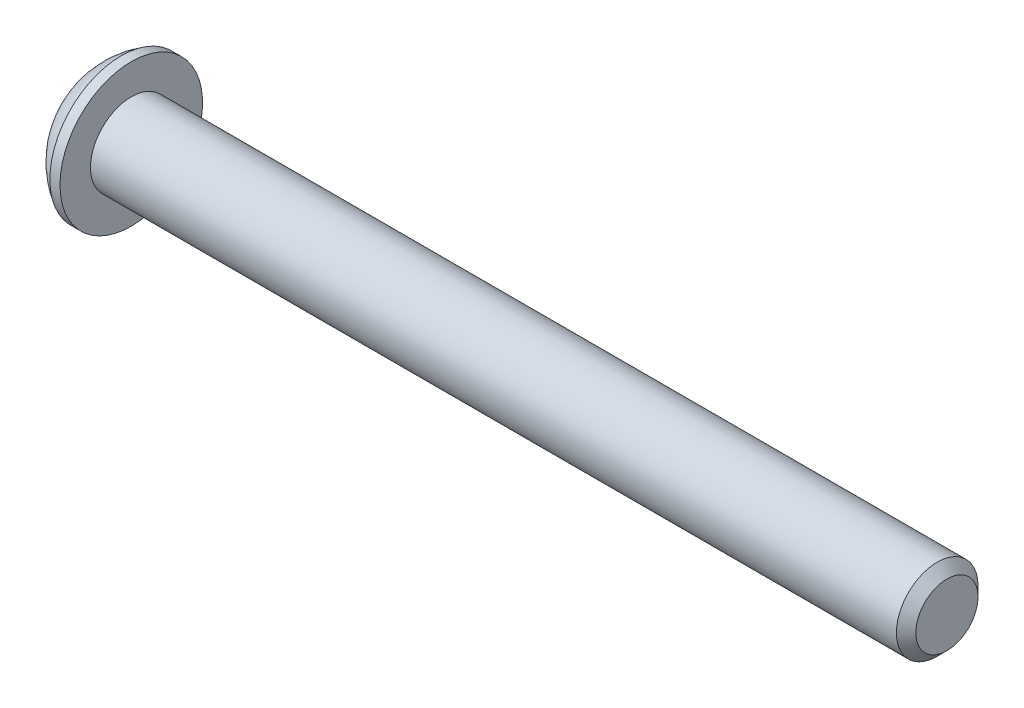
ISO-10303-21;
HEADER;
FILE_DESCRIPTION(('STEP AP214'),'2;1');
FILE_NAME('part.step','',(''),(''),'','','');
FILE_SCHEMA(('AUTOMOTIVE_DESIGN { 1 0 10303 214 1 1 1 1 }'));
ENDSEC;
DATA;
#1=APPLICATION_CONTEXT('core data for automotive mechanical design processes');
#2=APPLICATION_PROTOCOL_DEFINITION('international standard','automotive_design',2000,#1);
#3=PRODUCT_CONTEXT('',#1,'mechanical');
#4=PRODUCT('Part','Part','',(#3));
#5=PRODUCT_RELATED_PRODUCT_CATEGORY('part','',(#4));
#6=PRODUCT_DEFINITION_FORMATION('','',#4);
#7=PRODUCT_DEFINITION_CONTEXT('part definition',#1,'design');
#8=PRODUCT_DEFINITION('design','',#6,#7);
#9=PRODUCT_DEFINITION_SHAPE('','',#8);
#10=(LENGTH_UNIT() NAMED_UNIT(*) SI_UNIT(.MILLI.,.METRE.));
#11=(NAMED_UNIT(*) PLANE_ANGLE_UNIT() SI_UNIT($,.RADIAN.));
#12=(NAMED_UNIT(*) SI_UNIT($,.STERADIAN.) SOLID_ANGLE_UNIT());
#13=UNCERTAINTY_MEASURE_WITH_UNIT(LENGTH_MEASURE(1.E-05),#10,'distance_accuracy_value','');
#14=(GEOMETRIC_REPRESENTATION_CONTEXT(3) GLOBAL_UNCERTAINTY_ASSIGNED_CONTEXT((#13)) GLOBAL_UNIT_ASSIGNED_CONTEXT((#10,
#11,#12)) REPRESENTATION_CONTEXT('',''));
#15=CARTESIAN_POINT('',(0.,0.,0.));
#16=DIRECTION('',(0.,0.,1.));
#17=DIRECTION('',(1.,0.,0.));
#18=AXIS2_PLACEMENT_3D('',#15,#16,#17);
#19=CARTESIAN_POINT('',(0.,0.,0.));
#20=DIRECTION('',(-1.,0.,0.));
#21=DIRECTION('',(0.,0.,1.));
#22=AXIS2_PLACEMENT_3D('',#19,#20,#21);
#23=PLANE('',#22);
#24=CARTESIAN_POINT('',(0.,0.,0.));
#25=DIRECTION('',(-1.,0.,0.));
#26=DIRECTION('',(0.,0.,1.));
#27=AXIS2_PLACEMENT_3D('',#24,#25,#26);
#28=CIRCLE('',#27,2.77495);
#29=CARTESIAN_POINT('',(0.,2.77495,0.));
#30=VERTEX_POINT('',#29);
#31=EDGE_CURVE('E11',#30,#30,#28,.T.);
#32=ORIENTED_EDGE('',*,*,#31,.T.);
#33=EDGE_LOOP('',(#32));
#34=FACE_BOUND('',#33,.T.);
#35=DIRECTION('',(0.,-1.,0.));
#36=VECTOR('',#35,1.);
#37=CARTESIAN_POINT('',(0.,-1.14384635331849,1.9812));
#38=LINE('',#37,#36);
#39=CARTESIAN_POINT('',(0.,1.14384635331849,1.9812));
#40=VERTEX_POINT('',#39);
#41=CARTESIAN_POINT('',(0.,-1.14384635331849,1.9812));
#42=VERTEX_POINT('',#41);
#43=EDGE_CURVE('E46',#40,#42,#38,.T.);
#44=ORIENTED_EDGE('',*,*,#43,.T.);
#45=DIRECTION('',(0.,-0.5,-0.866025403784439));
#46=VECTOR('',#45,1.);
#47=CARTESIAN_POINT('',(0.,-2.28769270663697,0.));
#48=LINE('',#47,#46);
#49=CARTESIAN_POINT('',(0.,-2.28769270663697,0.));
#50=VERTEX_POINT('',#49);
#51=EDGE_CURVE('E362',#42,#50,#48,.T.);
#52=ORIENTED_EDGE('',*,*,#51,.T.);
#53=DIRECTION('',(0.,0.5,-0.866025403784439));
#54=VECTOR('',#53,1.);
#55=CARTESIAN_POINT('',(0.,-1.14384635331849,-1.9812));
#56=LINE('',#55,#54);
#57=CARTESIAN_POINT('',(0.,-1.14384635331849,-1.9812));
#58=VERTEX_POINT('',#57);
#59=EDGE_CURVE('E126',#50,#58,#56,.T.);
#60=ORIENTED_EDGE('',*,*,#59,.T.);
#61=DIRECTION('',(0.,1.,0.));
#62=VECTOR('',#61,1.);
#63=CARTESIAN_POINT('',(0.,1.14384635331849,-1.9812));
#64=LINE('',#63,#62);
#65=CARTESIAN_POINT('',(0.,1.14384635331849,-1.9812));
#66=VERTEX_POINT('',#65);
#67=EDGE_CURVE('E365',#58,#66,#64,.T.);
#68=ORIENTED_EDGE('',*,*,#67,.T.);
#69=DIRECTION('',(0.,0.5,0.866025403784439));
#70=VECTOR('',#69,1.);
#71=CARTESIAN_POINT('',(0.,2.28769270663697,0.));
#72=LINE('',#71,#70);
#73=CARTESIAN_POINT('',(0.,2.28769270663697,0.));
#74=VERTEX_POINT('',#73);
#75=EDGE_CURVE('E367',#66,#74,#72,.T.);
#76=ORIENTED_EDGE('',*,*,#75,.T.);
#77=DIRECTION('',(0.,-0.5,0.866025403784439));
#78=VECTOR('',#77,1.);
#79=CARTESIAN_POINT('',(0.,1.14384635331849,1.9812));
#80=LINE('',#79,#78);
#81=EDGE_CURVE('E369',#74,#40,#80,.T.);
#82=ORIENTED_EDGE('',*,*,#81,.T.);
#83=EDGE_LOOP('',(#44,#52,#60,#68,#76,#82));
#84=FACE_BOUND('',#83,.T.);
#85=ADVANCED_FACE('F32',(#34,#84),#23,.T.);
#86=CARTESIAN_POINT('',(5.78512506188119,0.,0.));
#87=DIRECTION('',(-1.,0.,0.));
#88=DIRECTION('',(0.,1.,0.));
#89=AXIS2_PLACEMENT_3D('',#86,#87,#88);
#90=SPHERICAL_SURFACE('',#89,6.41623094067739);
#91=CARTESIAN_POINT('',(2.5654,0.,0.));
#92=DIRECTION('',(-1.,0.,0.));
#93=DIRECTION('',(0.,0.,1.));
#94=AXIS2_PLACEMENT_3D('',#91,#92,#93);
#95=CIRCLE('',#94,5.5499);
#96=CARTESIAN_POINT('',(2.5654,5.5499,0.));
#97=VERTEX_POINT('',#96);
#98=EDGE_CURVE('E39',#97,#97,#95,.T.);
#99=CARTESIAN_POINT('',(2.5654,5.5499,0.));
#100=CARTESIAN_POINT('',(2.53083708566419,5.52984868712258,0.));
#101=CARTESIAN_POINT('',(2.49646152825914,5.50947442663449,0.));
#102=CARTESIAN_POINT('',(2.42809701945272,5.4680872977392,0.));
#103=CARTESIAN_POINT('',(2.39410806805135,5.447074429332,0.));
#104=CARTESIAN_POINT('',(2.32652866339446,5.40441737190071,0.));
#105=CARTESIAN_POINT('',(2.29293821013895,5.38277318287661,0.));
#106=CARTESIAN_POINT('',(2.22616751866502,5.33886105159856,0.));
#107=CARTESIAN_POINT('',(2.19298728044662,5.3165931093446,0.));
#108=CARTESIAN_POINT('',(2.12704860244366,5.27144124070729,0.));
#109=CARTESIAN_POINT('',(2.09429016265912,5.24855731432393,0.));
#110=CARTESIAN_POINT('',(2.02920651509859,5.20218146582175,0.));
#111=CARTESIAN_POINT('',(1.99688130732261,5.17868954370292,0.));
#112=CARTESIAN_POINT('',(1.93267540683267,5.13110590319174,0.));
#113=CARTESIAN_POINT('',(1.90079471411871,5.10701418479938,0.));
#114=CARTESIAN_POINT('',(1.83748897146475,5.05823936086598,0.));
#115=CARTESIAN_POINT('',(1.80606392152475,5.03355625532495,0.));
#116=CARTESIAN_POINT('',(1.74368043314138,4.98360727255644,0.));
#117=CARTESIAN_POINT('',(1.71272199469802,4.95834139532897,0.));
#118=CARTESIAN_POINT('',(1.65128253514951,4.90723568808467,0.));
#119=CARTESIAN_POINT('',(1.62080151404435,4.88139585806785,0.));
#120=CARTESIAN_POINT('',(1.56032752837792,4.82915126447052,0.));
#121=CARTESIAN_POINT('',(1.53033456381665,4.80274650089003,0.));
#122=CARTESIAN_POINT('',(1.4708471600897,4.74938125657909,0.));
#123=CARTESIAN_POINT('',(1.44135272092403,4.72242077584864,0.));
#124=CARTESIAN_POINT('',(1.38287266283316,4.66795350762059,0.));
#125=CARTESIAN_POINT('',(1.35388704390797,4.64044672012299,0.));
#126=CARTESIAN_POINT('',(1.29643474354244,4.58489643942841,0.));
#127=CARTESIAN_POINT('',(1.26796806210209,4.55685294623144,0.));
#128=CARTESIAN_POINT('',(1.21156357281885,4.50023904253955,0.));
#129=CARTESIAN_POINT('',(1.18362576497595,4.47166863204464,0.));
#130=CARTESIAN_POINT('',(1.12828877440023,4.41401086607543,0.));
#131=CARTESIAN_POINT('',(1.10088959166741,4.38492351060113,0.));
#132=CARTESIAN_POINT('',(1.04663941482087,4.32624200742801,0.));
#133=CARTESIAN_POINT('',(1.01978842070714,4.2966478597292,0.));
#134=CARTESIAN_POINT('',(0.966643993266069,4.2369631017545,0.));
#135=CARTESIAN_POINT('',(0.94035055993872,4.20687249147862,0.));
#136=CARTESIAN_POINT('',(0.888330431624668,4.14620531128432,0.));
#137=CARTESIAN_POINT('',(0.862603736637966,4.11562874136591,0.));
#138=CARTESIAN_POINT('',(0.811726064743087,4.05400031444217,0.));
#139=CARTESIAN_POINT('',(0.786575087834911,4.02294845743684,0.));
#140=CARTESIAN_POINT('',(0.736857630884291,3.96038029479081,0.));
#141=CARTESIAN_POINT('',(0.712291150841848,3.9288639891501,0.));
#142=CARTESIAN_POINT('',(0.6637512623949,3.8653779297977,0.));
#143=CARTESIAN_POINT('',(0.639777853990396,3.833408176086,0.));
#144=CARTESIAN_POINT('',(0.592432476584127,3.76902637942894,0.));
#145=CARTESIAN_POINT('',(0.569060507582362,3.73661433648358,0.));
#146=CARTESIAN_POINT('',(0.522926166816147,3.67135927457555,0.));
#147=CARTESIAN_POINT('',(0.500163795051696,3.63851625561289,0.));
#148=CARTESIAN_POINT('',(0.455256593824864,3.57241070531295,0.));
#149=CARTESIAN_POINT('',(0.433111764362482,3.53914817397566,0.));
#150=CARTESIAN_POINT('',(0.389447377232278,3.47221520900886,0.));
#151=CARTESIAN_POINT('',(0.367927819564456,3.43854477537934,0.));
#152=CARTESIAN_POINT('',(0.325521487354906,3.37080775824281,0.));
#153=CARTESIAN_POINT('',(0.304634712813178,3.3367411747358,0.));
#154=CARTESIAN_POINT('',(0.263501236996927,3.26822374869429,0.));
#155=CARTESIAN_POINT('',(0.243254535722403,3.23377290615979,0.));
#156=CARTESIAN_POINT('',(0.203408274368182,3.16449898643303,0.));
#157=CARTESIAN_POINT('',(0.183808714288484,3.12967590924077,0.));
#158=CARTESIAN_POINT('',(0.14526357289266,3.05966967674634,0.));
#159=CARTESIAN_POINT('',(0.126317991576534,3.02448652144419,0.));
#160=CARTESIAN_POINT('',(0.089087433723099,2.95377240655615,0.));
#161=CARTESIAN_POINT('',(0.0708024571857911,2.91824144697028,0.));
#162=CARTESIAN_POINT('',(0.0348994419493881,2.84684415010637,0.));
#163=CARTESIAN_POINT('',(0.017281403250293,2.81097781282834,0.));
#164=CARTESIAN_POINT('',(0.,2.77495,0.));
#165=B_SPLINE_CURVE_WITH_KNOTS('',3,(#99,#100,#101,#102,#103,#104,#105,#106,#107,#108,#109,#110,
#111,#112,#113,#114,#115,#116,#117,#118,#119,#120,#121,#122,#123,#124,#125,#126,#127,#128,#129,
#130,#131,#132,#133,#134,#135,#136,#137,#138,#139,#140,#141,#142,#143,#144,#145,#146,#147,#148,
#149,#150,#151,#152,#153,#154,#155,#156,#157,#158,#159,#160,#161,#162,#163,#164),.UNSPECIFIED.,
.F.,.F.,(4,2,2,2,2,2,2,2,2,2,2,2,2,2,2,2,2,2,2,2,2,2,2,2,2,2,2,2,2,2,2,2,4),(0.,
0.119872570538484,0.239745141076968,0.359617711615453,0.479490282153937,0.599362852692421,
0.719235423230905,0.83910799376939,0.958980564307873,1.07885313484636,1.19872570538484,
1.31859827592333,1.43847084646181,1.55834341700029,1.67821598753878,1.79808855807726,
1.91796112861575,2.03783369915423,2.15770626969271,2.2775788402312,2.39745141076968,
2.51732398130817,2.63719655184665,2.75706912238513,2.87694169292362,2.9968142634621,
3.11668683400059,3.23655940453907,3.35643197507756,3.47630454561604,3.59617711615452,
3.71604968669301,3.83592225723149),.UNSPECIFIED.);
#166=EDGE_CURVE('BSEAM153',#97,#30,#165,.T.);
#167=ORIENTED_EDGE('',*,*,#98,.T.);
#168=ORIENTED_EDGE('',*,*,#31,.F.);
#169=ORIENTED_EDGE('',*,*,#166,.T.);
#170=ORIENTED_EDGE('',*,*,#166,.F.);
#171=EDGE_LOOP('',(#167,#169,#168,#170));
#172=FACE_BOUND('',#171,.T.);
#173=ADVANCED_FACE('F153',(#172),#90,.T.);
#174=CARTESIAN_POINT('',(0.,0.,0.));
#175=DIRECTION('',(-1.,0.,0.));
#176=DIRECTION('',(0.,0.,1.));
#177=AXIS2_PLACEMENT_3D('',#174,#175,#176);
#178=CYLINDRICAL_SURFACE('',#177,5.5499);
#179=ORIENTED_EDGE('',*,*,#98,.F.);
#180=EDGE_LOOP('',(#179));
#181=FACE_BOUND('',#180,.T.);
#182=CARTESIAN_POINT('',(3.3528,0.,0.));
#183=DIRECTION('',(-1.,0.,0.));
#184=DIRECTION('',(0.,0.,1.));
#185=AXIS2_PLACEMENT_3D('',#182,#183,#184);
#186=CIRCLE('',#185,5.5499);
#187=CARTESIAN_POINT('',(3.3528,0.,5.5499));
#188=VERTEX_POINT('',#187);
#189=EDGE_CURVE('E148',#188,#188,#186,.T.);
#190=ORIENTED_EDGE('',*,*,#189,.T.);
#191=EDGE_LOOP('',(#190));
#192=FACE_BOUND('',#191,.T.);
#193=ADVANCED_FACE('F156',(#181,#192),#178,.T.);
#194=CARTESIAN_POINT('',(3.3528,3.17499999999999,0.));
#195=DIRECTION('',(-1.,0.,0.));
#196=DIRECTION('',(0.,0.,1.));
#197=AXIS2_PLACEMENT_3D('',#194,#195,#196);
#198=PLANE('',#197);
#199=ORIENTED_EDGE('',*,*,#189,.F.);
#200=EDGE_LOOP('',(#199));
#201=FACE_BOUND('',#200,.T.);
#202=CARTESIAN_POINT('',(3.3528,0.,0.));
#203=DIRECTION('',(-1.,0.,0.));
#204=DIRECTION('',(0.,0.,1.));
#205=AXIS2_PLACEMENT_3D('',#202,#203,#204);
#206=CIRCLE('',#205,3.17499999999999);
#207=CARTESIAN_POINT('',(3.3528,0.,3.17499999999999));
#208=VERTEX_POINT('',#207);
#209=EDGE_CURVE('E145',#208,#208,#206,.T.);
#210=ORIENTED_EDGE('',*,*,#209,.T.);
#211=EDGE_LOOP('',(#210));
#212=FACE_BOUND('',#211,.T.);
#213=ADVANCED_FACE('F159',(#201,#212),#198,.F.);
#214=CARTESIAN_POINT('',(0.,0.,0.));
#215=DIRECTION('',(-1.,0.,0.));
#216=DIRECTION('',(0.,0.,1.));
#217=AXIS2_PLACEMENT_3D('',#214,#215,#216);
#218=CYLINDRICAL_SURFACE('',#217,3.175);
#219=ORIENTED_EDGE('',*,*,#209,.F.);
#220=EDGE_LOOP('',(#219));
#221=FACE_BOUND('',#220,.T.);
#222=CARTESIAN_POINT('',(66.09715,0.,0.));
#223=DIRECTION('',(-1.,0.,0.));
#224=DIRECTION('',(0.,0.,1.));
#225=AXIS2_PLACEMENT_3D('',#222,#223,#224);
#226=CIRCLE('',#225,3.175);
#227=CARTESIAN_POINT('',(66.09715,0.,3.175));
#228=VERTEX_POINT('',#227);
#229=EDGE_CURVE('E142',#228,#228,#226,.T.);
#230=ORIENTED_EDGE('',*,*,#229,.T.);
#231=EDGE_LOOP('',(#230));
#232=FACE_BOUND('',#231,.T.);
#233=ADVANCED_FACE('F165',(#221,#232),#218,.T.);
#234=CARTESIAN_POINT('',(66.8528,0.,0.));
#235=DIRECTION('',(-1.,0.,0.));
#236=DIRECTION('',(0.,0.,1.));
#237=AXIS2_PLACEMENT_3D('',#234,#235,#236);
#238=CONICAL_SURFACE('',#237,2.41935,0.785398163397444);
#239=ORIENTED_EDGE('',*,*,#229,.F.);
#240=EDGE_LOOP('',(#239));
#241=FACE_BOUND('',#240,.T.);
#242=CARTESIAN_POINT('',(66.8528,0.,0.));
#243=DIRECTION('',(-1.,0.,0.));
#244=DIRECTION('',(0.,0.,1.));
#245=AXIS2_PLACEMENT_3D('',#242,#243,#244);
#246=CIRCLE('',#245,2.41935);
#247=CARTESIAN_POINT('',(66.8528,0.,2.41935));
#248=VERTEX_POINT('',#247);
#249=EDGE_CURVE('E138',#248,#248,#246,.T.);
#250=ORIENTED_EDGE('',*,*,#249,.T.);
#251=EDGE_LOOP('',(#250));
#252=FACE_BOUND('',#251,.T.);
#253=ADVANCED_FACE('F171',(#241,#252),#238,.T.);
#254=CARTESIAN_POINT('',(66.8528,0.,0.));
#255=DIRECTION('',(-1.,0.,0.));
#256=DIRECTION('',(0.,0.,1.));
#257=AXIS2_PLACEMENT_3D('',#254,#255,#256);
#258=PLANE('',#257);
#259=ORIENTED_EDGE('',*,*,#249,.F.);
#260=EDGE_LOOP('',(#259));
#261=FACE_BOUND('',#260,.T.);
#262=ADVANCED_FACE('F177',(#261),#258,.F.);
#263=CARTESIAN_POINT('',(2.2098,-2.28769270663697,0.));
#264=DIRECTION('',(0.,0.866025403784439,-0.5));
#265=DIRECTION('',(0.,0.5,0.866025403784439));
#266=AXIS2_PLACEMENT_3D('',#263,#264,#265);
#267=PLANE('',#266);
#268=DIRECTION('',(0.,-0.5,-0.866025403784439));
#269=VECTOR('',#268,1.);
#270=CARTESIAN_POINT('',(2.2098,-2.28769270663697,0.));
#271=LINE('',#270,#269);
#272=CARTESIAN_POINT('',(2.2098,-1.14384635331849,1.9812));
#273=VERTEX_POINT('',#272);
#274=CARTESIAN_POINT('',(2.2098,-1.71576952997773,0.9906));
#275=VERTEX_POINT('',#274);
#276=EDGE_CURVE('E112',#273,#275,#271,.T.);
#277=ORIENTED_EDGE('',*,*,#276,.T.);
#278=CARTESIAN_POINT('',(2.2098,-2.28769270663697,0.));
#279=VERTEX_POINT('',#278);
#280=EDGE_CURVE('E107',#275,#279,#271,.T.);
#281=ORIENTED_EDGE('',*,*,#280,.T.);
#282=DIRECTION('',(-1.,0.,0.));
#283=VECTOR('',#282,1.);
#284=CARTESIAN_POINT('',(2.2098,-2.28769270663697,0.));
#285=LINE('',#284,#283);
#286=EDGE_CURVE('E109',#279,#50,#285,.T.);
#287=ORIENTED_EDGE('',*,*,#286,.T.);
#288=ORIENTED_EDGE('',*,*,#51,.F.);
#289=DIRECTION('',(-1.,0.,0.));
#290=VECTOR('',#289,1.);
#291=CARTESIAN_POINT('',(2.2098,-1.14384635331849,1.9812));
#292=LINE('',#291,#290);
#293=EDGE_CURVE('E357',#273,#42,#292,.T.);
#294=ORIENTED_EDGE('',*,*,#293,.F.);
#295=EDGE_LOOP('',(#277,#281,#287,#288,#294));
#296=FACE_BOUND('',#295,.T.);
#297=ADVANCED_FACE('F108',(#296),#267,.T.);
#298=CARTESIAN_POINT('',(2.2098,-1.14384635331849,-1.9812));
#299=DIRECTION('',(0.,0.866025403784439,0.5));
#300=DIRECTION('',(0.,-0.5,0.866025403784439));
#301=AXIS2_PLACEMENT_3D('',#298,#299,#300);
#302=PLANE('',#301);
#303=DIRECTION('',(0.,0.5,-0.866025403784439));
#304=VECTOR('',#303,1.);
#305=CARTESIAN_POINT('',(2.2098,-1.14384635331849,-1.9812));
#306=LINE('',#305,#304);
#307=CARTESIAN_POINT('',(2.2098,-1.71576952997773,-0.9906));
#308=VERTEX_POINT('',#307);
#309=EDGE_CURVE('E54',#279,#308,#306,.T.);
#310=ORIENTED_EDGE('',*,*,#309,.T.);
#311=CARTESIAN_POINT('',(2.2098,-1.14384635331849,-1.9812));
#312=VERTEX_POINT('',#311);
#313=EDGE_CURVE('E121',#308,#312,#306,.T.);
#314=ORIENTED_EDGE('',*,*,#313,.T.);
#315=DIRECTION('',(-1.,0.,0.));
#316=VECTOR('',#315,1.);
#317=CARTESIAN_POINT('',(2.2098,-1.14384635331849,-1.9812));
#318=LINE('',#317,#316);
#319=EDGE_CURVE('E128',#312,#58,#318,.T.);
#320=ORIENTED_EDGE('',*,*,#319,.T.);
#321=ORIENTED_EDGE('',*,*,#59,.F.);
#322=ORIENTED_EDGE('',*,*,#286,.F.);
#323=EDGE_LOOP('',(#310,#314,#320,#321,#322));
#324=FACE_BOUND('',#323,.T.);
#325=ADVANCED_FACE('F124',(#324),#302,.T.);
#326=CARTESIAN_POINT('',(2.2098,1.14384635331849,-1.9812));
#327=DIRECTION('',(0.,0.,1.));
#328=DIRECTION('',(1.,0.,0.));
#329=AXIS2_PLACEMENT_3D('',#326,#327,#328);
#330=PLANE('',#329);
#331=DIRECTION('',(0.,1.,0.));
#332=VECTOR('',#331,1.);
#333=CARTESIAN_POINT('',(2.2098,1.14384635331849,-1.9812));
#334=LINE('',#333,#332);
#335=CARTESIAN_POINT('',(2.2098,0.,-1.9812));
#336=VERTEX_POINT('',#335);
#337=EDGE_CURVE('E387',#312,#336,#334,.T.);
#338=ORIENTED_EDGE('',*,*,#337,.T.);
#339=CARTESIAN_POINT('',(2.2098,1.14384635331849,-1.9812));
#340=VERTEX_POINT('',#339);
#341=EDGE_CURVE('E120',#336,#340,#334,.T.);
#342=ORIENTED_EDGE('',*,*,#341,.T.);
#343=DIRECTION('',(-1.,0.,0.));
#344=VECTOR('',#343,1.);
#345=CARTESIAN_POINT('',(2.2098,1.14384635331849,-1.9812));
#346=LINE('',#345,#344);
#347=EDGE_CURVE('E133',#340,#66,#346,.T.);
#348=ORIENTED_EDGE('',*,*,#347,.T.);
#349=ORIENTED_EDGE('',*,*,#67,.F.);
#350=ORIENTED_EDGE('',*,*,#319,.F.);
#351=EDGE_LOOP('',(#338,#342,#348,#349,#350));
#352=FACE_BOUND('',#351,.T.);
#353=ADVANCED_FACE('F236',(#352),#330,.T.);
#354=CARTESIAN_POINT('',(2.2098,2.28769270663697,0.));
#355=DIRECTION('',(0.,-0.866025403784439,0.5));
#356=DIRECTION('',(0.,-0.5,-0.866025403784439));
#357=AXIS2_PLACEMENT_3D('',#354,#355,#356);
#358=PLANE('',#357);
#359=DIRECTION('',(0.,0.5,0.866025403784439));
#360=VECTOR('',#359,1.);
#361=CARTESIAN_POINT('',(2.2098,2.28769270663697,0.));
#362=LINE('',#361,#360);
#363=CARTESIAN_POINT('',(2.2098,1.71576952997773,-0.990600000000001));
#364=VERTEX_POINT('',#363);
#365=EDGE_CURVE('E391',#340,#364,#362,.T.);
#366=ORIENTED_EDGE('',*,*,#365,.T.);
#367=CARTESIAN_POINT('',(2.2098,2.28769270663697,0.));
#368=VERTEX_POINT('',#367);
#369=EDGE_CURVE('E389',#364,#368,#362,.T.);
#370=ORIENTED_EDGE('',*,*,#369,.T.);
#371=DIRECTION('',(-1.,0.,0.));
#372=VECTOR('',#371,1.);
#373=CARTESIAN_POINT('',(2.2098,2.28769270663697,0.));
#374=LINE('',#373,#372);
#375=EDGE_CURVE('E373',#368,#74,#374,.T.);
#376=ORIENTED_EDGE('',*,*,#375,.T.);
#377=ORIENTED_EDGE('',*,*,#75,.F.);
#378=ORIENTED_EDGE('',*,*,#347,.F.);
#379=EDGE_LOOP('',(#366,#370,#376,#377,#378));
#380=FACE_BOUND('',#379,.T.);
#381=ADVANCED_FACE('F245',(#380),#358,.T.);
#382=CARTESIAN_POINT('',(2.2098,1.14384635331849,1.9812));
#383=DIRECTION('',(0.,-0.866025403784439,-0.5));
#384=DIRECTION('',(0.,0.5,-0.866025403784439));
#385=AXIS2_PLACEMENT_3D('',#382,#383,#384);
#386=PLANE('',#385);
#387=DIRECTION('',(0.,-0.5,0.866025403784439));
#388=VECTOR('',#387,1.);
#389=CARTESIAN_POINT('',(2.2098,1.14384635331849,1.9812));
#390=LINE('',#389,#388);
#391=CARTESIAN_POINT('',(2.2098,1.71576952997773,0.990600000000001));
#392=VERTEX_POINT('',#391);
#393=EDGE_CURVE('E352',#368,#392,#390,.T.);
#394=ORIENTED_EDGE('',*,*,#393,.T.);
#395=CARTESIAN_POINT('',(2.2098,1.14384635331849,1.9812));
#396=VERTEX_POINT('',#395);
#397=EDGE_CURVE('E348',#392,#396,#390,.T.);
#398=ORIENTED_EDGE('',*,*,#397,.T.);
#399=DIRECTION('',(-1.,0.,0.));
#400=VECTOR('',#399,1.);
#401=CARTESIAN_POINT('',(2.2098,1.14384635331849,1.9812));
#402=LINE('',#401,#400);
#403=EDGE_CURVE('E356',#396,#40,#402,.T.);
#404=ORIENTED_EDGE('',*,*,#403,.T.);
#405=ORIENTED_EDGE('',*,*,#81,.F.);
#406=ORIENTED_EDGE('',*,*,#375,.F.);
#407=EDGE_LOOP('',(#394,#398,#404,#405,#406));
#408=FACE_BOUND('',#407,.T.);
#409=ADVANCED_FACE('F255',(#408),#386,.T.);
#410=CARTESIAN_POINT('',(2.2098,-1.14384635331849,1.9812));
#411=DIRECTION('',(0.,0.,-1.));
#412=DIRECTION('',(0.,1.,0.));
#413=AXIS2_PLACEMENT_3D('',#410,#411,#412);
#414=PLANE('',#413);
#415=DIRECTION('',(0.,-1.,0.));
#416=VECTOR('',#415,1.);
#417=CARTESIAN_POINT('',(2.2098,-1.14384635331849,1.9812));
#418=LINE('',#417,#416);
#419=CARTESIAN_POINT('',(2.2098,0.,1.9812));
#420=VERTEX_POINT('',#419);
#421=EDGE_CURVE('E347',#396,#420,#418,.T.);
#422=ORIENTED_EDGE('',*,*,#421,.T.);
#423=EDGE_CURVE('E350',#420,#273,#418,.T.);
#424=ORIENTED_EDGE('',*,*,#423,.T.);
#425=ORIENTED_EDGE('',*,*,#293,.T.);
#426=ORIENTED_EDGE('',*,*,#43,.F.);
#427=ORIENTED_EDGE('',*,*,#403,.F.);
#428=EDGE_LOOP('',(#422,#424,#425,#426,#427));
#429=FACE_BOUND('',#428,.T.);
#430=ADVANCED_FACE('F265',(#429),#414,.T.);
#431=CARTESIAN_POINT('',(2.2098,-2.28769270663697,0.));
#432=DIRECTION('',(1.,0.,0.));
#433=DIRECTION('',(0.,0.,-1.));
#434=AXIS2_PLACEMENT_3D('',#431,#432,#433);
#435=PLANE('',#434);
#436=CARTESIAN_POINT('',(2.2098,0.,0.));
#437=DIRECTION('',(-1.,0.,0.));
#438=DIRECTION('',(0.,0.,1.));
#439=AXIS2_PLACEMENT_3D('',#436,#437,#438);
#440=CIRCLE('',#439,1.9812);
#441=EDGE_CURVE('E394',#364,#336,#440,.T.);
#442=ORIENTED_EDGE('',*,*,#441,.F.);
#443=ORIENTED_EDGE('',*,*,#365,.F.);
#444=ORIENTED_EDGE('',*,*,#341,.F.);
#445=EDGE_LOOP('',(#442,#443,#444));
#446=FACE_BOUND('',#445,.T.);
#447=ADVANCED_FACE('F275',(#446),#435,.F.);
#448=EDGE_CURVE('E139',#392,#364,#440,.T.);
#449=ORIENTED_EDGE('',*,*,#448,.F.);
#450=ORIENTED_EDGE('',*,*,#393,.F.);
#451=ORIENTED_EDGE('',*,*,#369,.F.);
#452=EDGE_LOOP('',(#449,#450,#451));
#453=FACE_BOUND('',#452,.T.);
#454=ADVANCED_FACE('F285',(#453),#435,.F.);
#455=EDGE_CURVE('E132',#420,#392,#440,.T.);
#456=ORIENTED_EDGE('',*,*,#455,.F.);
#457=ORIENTED_EDGE('',*,*,#421,.F.);
#458=ORIENTED_EDGE('',*,*,#397,.F.);
#459=EDGE_LOOP('',(#456,#457,#458));
#460=FACE_BOUND('',#459,.T.);
#461=ADVANCED_FACE('F296',(#460),#435,.F.);
#462=EDGE_CURVE('E127',#275,#420,#440,.T.);
#463=ORIENTED_EDGE('',*,*,#462,.F.);
#464=ORIENTED_EDGE('',*,*,#276,.F.);
#465=ORIENTED_EDGE('',*,*,#423,.F.);
#466=EDGE_LOOP('',(#463,#464,#465));
#467=FACE_BOUND('',#466,.T.);
#468=ADVANCED_FACE('F305',(#467),#435,.F.);
#469=EDGE_CURVE('E118',#308,#275,#440,.T.);
#470=ORIENTED_EDGE('',*,*,#469,.F.);
#471=ORIENTED_EDGE('',*,*,#309,.F.);
#472=ORIENTED_EDGE('',*,*,#280,.F.);
#473=EDGE_LOOP('',(#470,#471,#472));
#474=FACE_BOUND('',#473,.T.);
#475=ADVANCED_FACE('F117',(#474),#435,.F.);
#476=EDGE_CURVE('E388',#336,#308,#440,.T.);
#477=ORIENTED_EDGE('',*,*,#476,.F.);
#478=ORIENTED_EDGE('',*,*,#337,.F.);
#479=ORIENTED_EDGE('',*,*,#313,.F.);
#480=EDGE_LOOP('',(#477,#478,#479));
#481=FACE_BOUND('',#480,.T.);
#482=ADVANCED_FACE('F288',(#481),#435,.F.);
#483=CARTESIAN_POINT('',(3.3536463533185,0.,0.));
#484=DIRECTION('',(-1.,0.,0.));
#485=DIRECTION('',(0.,0.,1.));
#486=AXIS2_PLACEMENT_3D('',#483,#484,#485);
#487=CONICAL_SURFACE('',#486,0.,1.04719755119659);
#488=ORIENTED_EDGE('',*,*,#455,.T.);
#489=ORIENTED_EDGE('',*,*,#448,.T.);
#490=ORIENTED_EDGE('',*,*,#441,.T.);
#491=ORIENTED_EDGE('',*,*,#476,.T.);
#492=ORIENTED_EDGE('',*,*,#469,.T.);
#493=ORIENTED_EDGE('',*,*,#462,.T.);
#494=EDGE_LOOP('',(#488,#489,#490,#491,#492,#493));
#495=FACE_BOUND('',#494,.T.);
#496=CARTESIAN_POINT('',(3.3536463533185,0.,0.));
#497=VERTEX_POINT('',#496);
#498=VERTEX_LOOP('',#497);
#499=FACE_BOUND('',#498,.T.);
#500=ADVANCED_FACE('F329',(#495,#499),#487,.F.);
#501=CLOSED_SHELL('',(#85,#173,#193,#213,#233,#253,#262,#297,#325,#353,#381,#409,#430,#447,#454,
#461,#468,#475,#482,#500));
#502=MANIFOLD_SOLID_BREP('B2',#501);
#503=ADVANCED_BREP_SHAPE_REPRESENTATION('',(#18,#502),#14);
#504=SHAPE_DEFINITION_REPRESENTATION(#9,#503);
ENDSEC;
END-ISO-10303-21;
